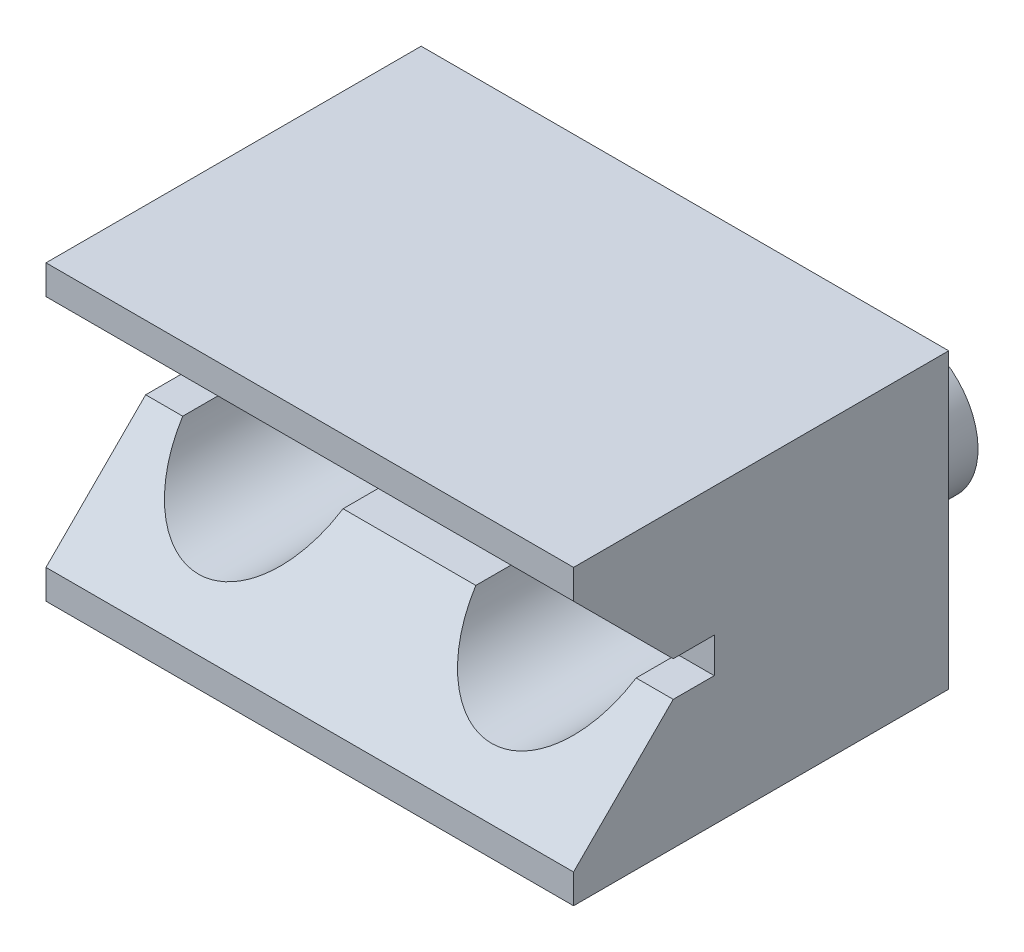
ISO-10303-21;
HEADER;
FILE_DESCRIPTION(('STEP AP214'),'2;1');
FILE_NAME('part.step','',(''),(''),'','','');
FILE_SCHEMA(('AUTOMOTIVE_DESIGN { 1 0 10303 214 1 1 1 1 }'));
ENDSEC;
DATA;
#1=APPLICATION_CONTEXT('core data for automotive mechanical design processes');
#2=APPLICATION_PROTOCOL_DEFINITION('international standard','automotive_design',2000,#1);
#3=PRODUCT_CONTEXT('',#1,'mechanical');
#4=PRODUCT('Part','Part','',(#3));
#5=PRODUCT_RELATED_PRODUCT_CATEGORY('part','',(#4));
#6=PRODUCT_DEFINITION_FORMATION('','',#4);
#7=PRODUCT_DEFINITION_CONTEXT('part definition',#1,'design');
#8=PRODUCT_DEFINITION('design','',#6,#7);
#9=PRODUCT_DEFINITION_SHAPE('','',#8);
#10=(LENGTH_UNIT() NAMED_UNIT(*) SI_UNIT(.MILLI.,.METRE.));
#11=(NAMED_UNIT(*) PLANE_ANGLE_UNIT() SI_UNIT($,.RADIAN.));
#12=(NAMED_UNIT(*) SI_UNIT($,.STERADIAN.) SOLID_ANGLE_UNIT());
#13=UNCERTAINTY_MEASURE_WITH_UNIT(LENGTH_MEASURE(1.E-05),#10,'distance_accuracy_value','');
#14=(GEOMETRIC_REPRESENTATION_CONTEXT(3) GLOBAL_UNCERTAINTY_ASSIGNED_CONTEXT((#13)) GLOBAL_UNIT_ASSIGNED_CONTEXT((#10,
#11,#12)) REPRESENTATION_CONTEXT('',''));
#15=CARTESIAN_POINT('',(0.,0.,0.));
#16=DIRECTION('',(0.,0.,1.));
#17=DIRECTION('',(1.,0.,0.));
#18=AXIS2_PLACEMENT_3D('',#15,#16,#17);
#19=CARTESIAN_POINT('',(35.,-12.5,0.));
#20=DIRECTION('',(0.,0.,1.));
#21=DIRECTION('',(0.,-1.,0.));
#22=AXIS2_PLACEMENT_3D('',#19,#20,#21);
#23=PLANE('',#22);
#24=CARTESIAN_POINT('',(0.,0.,0.));
#25=DIRECTION('',(0.,0.,1.));
#26=DIRECTION('',(0.,-1.,0.));
#27=AXIS2_PLACEMENT_3D('',#24,#25,#26);
#28=CIRCLE('',#27,6.);
#29=CARTESIAN_POINT('',(0.,-6.,0.));
#30=VERTEX_POINT('',#29);
#31=EDGE_CURVE('E405',#30,#30,#28,.T.);
#32=ORIENTED_EDGE('',*,*,#31,.T.);
#33=EDGE_LOOP('',(#32));
#34=FACE_BOUND('',#33,.T.);
#35=CARTESIAN_POINT('',(25.,0.,0.));
#36=DIRECTION('',(0.,0.,1.));
#37=DIRECTION('',(0.,-1.,0.));
#38=AXIS2_PLACEMENT_3D('',#35,#36,#37);
#39=CIRCLE('',#38,6.);
#40=CARTESIAN_POINT('',(25.,-6.,0.));
#41=VERTEX_POINT('',#40);
#42=EDGE_CURVE('E421',#41,#41,#39,.T.);
#43=ORIENTED_EDGE('',*,*,#42,.T.);
#44=EDGE_LOOP('',(#43));
#45=FACE_BOUND('',#44,.T.);
#46=DIRECTION('',(-1.,0.,0.));
#47=VECTOR('',#46,1.);
#48=CARTESIAN_POINT('',(35.,12.5,0.));
#49=LINE('',#48,#47);
#50=CARTESIAN_POINT('',(35.,12.5,0.));
#51=VERTEX_POINT('',#50);
#52=CARTESIAN_POINT('',(-10.,12.5,0.));
#53=VERTEX_POINT('',#52);
#54=EDGE_CURVE('E178',#51,#53,#49,.T.);
#55=ORIENTED_EDGE('',*,*,#54,.F.);
#56=DIRECTION('',(0.,1.,0.));
#57=VECTOR('',#56,1.);
#58=CARTESIAN_POINT('',(35.,-12.5,0.));
#59=LINE('',#58,#57);
#60=CARTESIAN_POINT('',(35.,-12.5,0.));
#61=VERTEX_POINT('',#60);
#62=EDGE_CURVE('E235',#61,#51,#59,.T.);
#63=ORIENTED_EDGE('',*,*,#62,.F.);
#64=DIRECTION('',(-1.,0.,0.));
#65=VECTOR('',#64,1.);
#66=CARTESIAN_POINT('',(35.,-12.5,0.));
#67=LINE('',#66,#65);
#68=CARTESIAN_POINT('',(-10.,-12.5,0.));
#69=VERTEX_POINT('',#68);
#70=EDGE_CURVE('E180',#61,#69,#67,.T.);
#71=ORIENTED_EDGE('',*,*,#70,.T.);
#72=DIRECTION('',(0.,1.,0.));
#73=VECTOR('',#72,1.);
#74=CARTESIAN_POINT('',(-10.,-12.5,0.));
#75=LINE('',#74,#73);
#76=EDGE_CURVE('E207',#69,#53,#75,.T.);
#77=ORIENTED_EDGE('',*,*,#76,.T.);
#78=EDGE_LOOP('',(#55,#63,#71,#77));
#79=FACE_BOUND('',#78,.T.);
#80=ADVANCED_FACE('F14',(#34,#45,#79),#23,.F.);
#81=CARTESIAN_POINT('',(35.,10.,32.));
#82=DIRECTION('',(0.,0.707106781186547,-0.707106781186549));
#83=DIRECTION('',(0.,0.707106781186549,0.707106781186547));
#84=AXIS2_PLACEMENT_3D('',#81,#82,#83);
#85=PLANE('',#84);
#86=CARTESIAN_POINT('',(0.,0.,22.));
#87=DIRECTION('',(0.,0.707106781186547,-0.707106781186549));
#88=DIRECTION('',(0.,-0.707106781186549,-0.707106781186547));
#89=AXIS2_PLACEMENT_3D('',#86,#87,#88);
#90=ELLIPSE('',#89,9.89949493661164,7.);
#91=CARTESIAN_POINT('',(6.83739716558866,1.5,23.5));
#92=VERTEX_POINT('',#91);
#93=CARTESIAN_POINT('',(-6.83739716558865,1.5,23.5));
#94=VERTEX_POINT('',#93);
#95=EDGE_CURVE('E445',#92,#94,#90,.F.);
#96=ORIENTED_EDGE('',*,*,#95,.F.);
#97=DIRECTION('',(-1.,0.,0.));
#98=VECTOR('',#97,1.);
#99=CARTESIAN_POINT('',(35.,1.5,23.5));
#100=LINE('',#99,#98);
#101=CARTESIAN_POINT('',(18.1626028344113,1.5,23.5));
#102=VERTEX_POINT('',#101);
#103=EDGE_CURVE('E174',#102,#92,#100,.T.);
#104=ORIENTED_EDGE('',*,*,#103,.F.);
#105=CARTESIAN_POINT('',(25.,0.,22.));
#106=DIRECTION('',(0.,0.707106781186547,-0.707106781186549));
#107=DIRECTION('',(0.,-0.707106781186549,-0.707106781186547));
#108=AXIS2_PLACEMENT_3D('',#105,#106,#107);
#109=ELLIPSE('',#108,9.89949493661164,7.);
#110=CARTESIAN_POINT('',(31.8373971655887,1.5,23.5));
#111=VERTEX_POINT('',#110);
#112=EDGE_CURVE('E201',#111,#102,#109,.F.);
#113=ORIENTED_EDGE('',*,*,#112,.F.);
#114=CARTESIAN_POINT('',(35.,1.5,23.5));
#115=VERTEX_POINT('',#114);
#116=EDGE_CURVE('E170',#115,#111,#100,.T.);
#117=ORIENTED_EDGE('',*,*,#116,.F.);
#118=DIRECTION('',(0.,-0.707106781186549,-0.707106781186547));
#119=VECTOR('',#118,1.);
#120=CARTESIAN_POINT('',(35.,10.,32.));
#121=LINE('',#120,#119);
#122=CARTESIAN_POINT('',(35.,10.,32.));
#123=VERTEX_POINT('',#122);
#124=EDGE_CURVE('E244',#123,#115,#121,.T.);
#125=ORIENTED_EDGE('',*,*,#124,.F.);
#126=DIRECTION('',(-1.,0.,0.));
#127=VECTOR('',#126,1.);
#128=CARTESIAN_POINT('',(35.,10.,32.));
#129=LINE('',#128,#127);
#130=CARTESIAN_POINT('',(-10.,10.,32.));
#131=VERTEX_POINT('',#130);
#132=EDGE_CURVE('E173',#123,#131,#129,.T.);
#133=ORIENTED_EDGE('',*,*,#132,.T.);
#134=DIRECTION('',(0.,-0.707106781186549,-0.707106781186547));
#135=VECTOR('',#134,1.);
#136=CARTESIAN_POINT('',(-10.,10.,32.));
#137=LINE('',#136,#135);
#138=CARTESIAN_POINT('',(-10.,1.5,23.5));
#139=VERTEX_POINT('',#138);
#140=EDGE_CURVE('E221',#131,#139,#137,.T.);
#141=ORIENTED_EDGE('',*,*,#140,.T.);
#142=EDGE_CURVE('E168',#94,#139,#100,.T.);
#143=ORIENTED_EDGE('',*,*,#142,.F.);
#144=EDGE_LOOP('',(#96,#104,#113,#117,#125,#133,#141,#143));
#145=FACE_BOUND('',#144,.T.);
#146=ADVANCED_FACE('F289',(#145),#85,.F.);
#147=CARTESIAN_POINT('',(35.,1.5,20.));
#148=DIRECTION('',(0.,-1.,0.));
#149=DIRECTION('',(0.,0.,-1.));
#150=AXIS2_PLACEMENT_3D('',#147,#148,#149);
#151=PLANE('',#150);
#152=DIRECTION('',(-1.,0.,0.));
#153=VECTOR('',#152,1.);
#154=CARTESIAN_POINT('',(35.,1.5,20.));
#155=LINE('',#154,#153);
#156=CARTESIAN_POINT('',(-6.83739716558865,1.5,20.));
#157=VERTEX_POINT('',#156);
#158=CARTESIAN_POINT('',(-10.,1.5,20.));
#159=VERTEX_POINT('',#158);
#160=EDGE_CURVE('E164',#157,#159,#155,.T.);
#161=ORIENTED_EDGE('',*,*,#160,.F.);
#162=DIRECTION('',(0.,0.,-1.));
#163=VECTOR('',#162,1.);
#164=CARTESIAN_POINT('',(-6.83739716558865,1.5,0.));
#165=LINE('',#164,#163);
#166=EDGE_CURVE('E442',#157,#94,#165,.F.);
#167=ORIENTED_EDGE('',*,*,#166,.T.);
#168=ORIENTED_EDGE('',*,*,#142,.T.);
#169=DIRECTION('',(0.,0.,1.));
#170=VECTOR('',#169,1.);
#171=CARTESIAN_POINT('',(-10.,1.5,20.));
#172=LINE('',#171,#170);
#173=EDGE_CURVE('E224',#159,#139,#172,.T.);
#174=ORIENTED_EDGE('',*,*,#173,.F.);
#175=EDGE_LOOP('',(#161,#167,#168,#174));
#176=FACE_BOUND('',#175,.T.);
#177=ADVANCED_FACE('F311',(#176),#151,.T.);
#178=ORIENTED_EDGE('',*,*,#103,.T.);
#179=DIRECTION('',(0.,0.,-1.));
#180=VECTOR('',#179,1.);
#181=CARTESIAN_POINT('',(6.83739716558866,1.5,0.));
#182=LINE('',#181,#180);
#183=CARTESIAN_POINT('',(6.83739716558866,1.5,20.));
#184=VERTEX_POINT('',#183);
#185=EDGE_CURVE('E439',#92,#184,#182,.T.);
#186=ORIENTED_EDGE('',*,*,#185,.T.);
#187=CARTESIAN_POINT('',(18.1626028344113,1.5,20.));
#188=VERTEX_POINT('',#187);
#189=EDGE_CURVE('E169',#188,#184,#155,.T.);
#190=ORIENTED_EDGE('',*,*,#189,.F.);
#191=DIRECTION('',(0.,0.,-1.));
#192=VECTOR('',#191,1.);
#193=CARTESIAN_POINT('',(18.1626028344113,1.5,0.));
#194=LINE('',#193,#192);
#195=EDGE_CURVE('E278',#188,#102,#194,.F.);
#196=ORIENTED_EDGE('',*,*,#195,.T.);
#197=EDGE_LOOP('',(#178,#186,#190,#196));
#198=FACE_BOUND('',#197,.T.);
#199=ADVANCED_FACE('F322',(#198),#151,.T.);
#200=CARTESIAN_POINT('',(35.,-1.5,20.));
#201=DIRECTION('',(0.,0.,1.));
#202=DIRECTION('',(0.,-1.,0.));
#203=AXIS2_PLACEMENT_3D('',#200,#201,#202);
#204=PLANE('',#203);
#205=DIRECTION('',(-1.,0.,0.));
#206=VECTOR('',#205,1.);
#207=CARTESIAN_POINT('',(35.,-1.5,20.));
#208=LINE('',#207,#206);
#209=CARTESIAN_POINT('',(-6.83739716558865,-1.5,20.));
#210=VERTEX_POINT('',#209);
#211=CARTESIAN_POINT('',(-10.,-1.5,20.));
#212=VERTEX_POINT('',#211);
#213=EDGE_CURVE('E156',#210,#212,#208,.T.);
#214=ORIENTED_EDGE('',*,*,#213,.F.);
#215=CARTESIAN_POINT('',(0.,0.,20.));
#216=DIRECTION('',(0.,0.,1.));
#217=DIRECTION('',(0.,-1.,0.));
#218=AXIS2_PLACEMENT_3D('',#215,#216,#217);
#219=CIRCLE('',#218,7.);
#220=EDGE_CURVE('E438',#210,#157,#219,.F.);
#221=ORIENTED_EDGE('',*,*,#220,.T.);
#222=ORIENTED_EDGE('',*,*,#160,.T.);
#223=DIRECTION('',(0.,1.,0.));
#224=VECTOR('',#223,1.);
#225=CARTESIAN_POINT('',(-10.,-1.5,20.));
#226=LINE('',#225,#224);
#227=EDGE_CURVE('E227',#212,#159,#226,.T.);
#228=ORIENTED_EDGE('',*,*,#227,.F.);
#229=EDGE_LOOP('',(#214,#221,#222,#228));
#230=FACE_BOUND('',#229,.T.);
#231=ADVANCED_FACE('F324',(#230),#204,.T.);
#232=ORIENTED_EDGE('',*,*,#189,.T.);
#233=CARTESIAN_POINT('',(6.83739716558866,-1.5,20.));
#234=VERTEX_POINT('',#233);
#235=EDGE_CURVE('E149',#184,#234,#219,.F.);
#236=ORIENTED_EDGE('',*,*,#235,.T.);
#237=CARTESIAN_POINT('',(18.1626028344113,-1.5,20.));
#238=VERTEX_POINT('',#237);
#239=EDGE_CURVE('E148',#238,#234,#208,.T.);
#240=ORIENTED_EDGE('',*,*,#239,.F.);
#241=CARTESIAN_POINT('',(25.,0.,20.));
#242=DIRECTION('',(0.,0.,1.));
#243=DIRECTION('',(0.,-1.,0.));
#244=AXIS2_PLACEMENT_3D('',#241,#242,#243);
#245=CIRCLE('',#244,7.);
#246=EDGE_CURVE('E270',#238,#188,#245,.F.);
#247=ORIENTED_EDGE('',*,*,#246,.T.);
#248=EDGE_LOOP('',(#232,#236,#240,#247));
#249=FACE_BOUND('',#248,.T.);
#250=ADVANCED_FACE('F327',(#249),#204,.T.);
#251=CARTESIAN_POINT('',(35.,-1.5,23.5));
#252=DIRECTION('',(0.,1.,0.));
#253=DIRECTION('',(0.,0.,1.));
#254=AXIS2_PLACEMENT_3D('',#251,#252,#253);
#255=PLANE('',#254);
#256=ORIENTED_EDGE('',*,*,#239,.T.);
#257=DIRECTION('',(0.,0.,-1.));
#258=VECTOR('',#257,1.);
#259=CARTESIAN_POINT('',(6.83739716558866,-1.5,0.));
#260=LINE('',#259,#258);
#261=CARTESIAN_POINT('',(6.83739716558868,-1.5,23.5));
#262=VERTEX_POINT('',#261);
#263=EDGE_CURVE('E137',#234,#262,#260,.F.);
#264=ORIENTED_EDGE('',*,*,#263,.T.);
#265=DIRECTION('',(-1.,0.,0.));
#266=VECTOR('',#265,1.);
#267=CARTESIAN_POINT('',(35.,-1.5,23.5));
#268=LINE('',#267,#266);
#269=CARTESIAN_POINT('',(18.1626028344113,-1.5,23.5));
#270=VERTEX_POINT('',#269);
#271=EDGE_CURVE('E146',#270,#262,#268,.T.);
#272=ORIENTED_EDGE('',*,*,#271,.F.);
#273=DIRECTION('',(0.,0.,-1.));
#274=VECTOR('',#273,1.);
#275=CARTESIAN_POINT('',(18.1626028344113,-1.5,0.));
#276=LINE('',#275,#274);
#277=EDGE_CURVE('E36',#270,#238,#276,.T.);
#278=ORIENTED_EDGE('',*,*,#277,.T.);
#279=EDGE_LOOP('',(#256,#264,#272,#278));
#280=FACE_BOUND('',#279,.T.);
#281=ADVANCED_FACE('F145',(#280),#255,.T.);
#282=CARTESIAN_POINT('',(-6.83739716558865,-1.5,23.5));
#283=VERTEX_POINT('',#282);
#284=CARTESIAN_POINT('',(-10.,-1.5,23.5));
#285=VERTEX_POINT('',#284);
#286=EDGE_CURVE('E154',#283,#285,#268,.T.);
#287=ORIENTED_EDGE('',*,*,#286,.F.);
#288=DIRECTION('',(0.,0.,-1.));
#289=VECTOR('',#288,1.);
#290=CARTESIAN_POINT('',(-6.83739716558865,-1.5,0.));
#291=LINE('',#290,#289);
#292=EDGE_CURVE('E29',#283,#210,#291,.T.);
#293=ORIENTED_EDGE('',*,*,#292,.T.);
#294=ORIENTED_EDGE('',*,*,#213,.T.);
#295=DIRECTION('',(0.,0.,-1.));
#296=VECTOR('',#295,1.);
#297=CARTESIAN_POINT('',(-10.,-1.5,23.5));
#298=LINE('',#297,#296);
#299=EDGE_CURVE('E230',#285,#212,#298,.T.);
#300=ORIENTED_EDGE('',*,*,#299,.F.);
#301=EDGE_LOOP('',(#287,#293,#294,#300));
#302=FACE_BOUND('',#301,.T.);
#303=ADVANCED_FACE('F332',(#302),#255,.T.);
#304=CARTESIAN_POINT('',(35.,-10.,32.));
#305=DIRECTION('',(0.,0.707106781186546,0.707106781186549));
#306=DIRECTION('',(0.,-0.707106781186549,0.707106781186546));
#307=AXIS2_PLACEMENT_3D('',#304,#305,#306);
#308=PLANE('',#307);
#309=ORIENTED_EDGE('',*,*,#271,.T.);
#310=CARTESIAN_POINT('',(0.,0.,22.));
#311=DIRECTION('',(0.,0.707106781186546,0.707106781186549));
#312=DIRECTION('',(0.,0.707106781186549,-0.707106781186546));
#313=AXIS2_PLACEMENT_3D('',#310,#311,#312);
#314=ELLIPSE('',#313,9.89949493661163,7.);
#315=EDGE_CURVE('E9',#262,#283,#314,.F.);
#316=ORIENTED_EDGE('',*,*,#315,.T.);
#317=ORIENTED_EDGE('',*,*,#286,.T.);
#318=DIRECTION('',(0.,0.707106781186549,-0.707106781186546));
#319=VECTOR('',#318,1.);
#320=CARTESIAN_POINT('',(-10.,-10.,32.));
#321=LINE('',#320,#319);
#322=CARTESIAN_POINT('',(-10.,-10.,32.));
#323=VERTEX_POINT('',#322);
#324=EDGE_CURVE('E200',#323,#285,#321,.T.);
#325=ORIENTED_EDGE('',*,*,#324,.F.);
#326=DIRECTION('',(-1.,0.,0.));
#327=VECTOR('',#326,1.);
#328=CARTESIAN_POINT('',(35.,-10.,32.));
#329=LINE('',#328,#327);
#330=CARTESIAN_POINT('',(35.,-10.,32.));
#331=VERTEX_POINT('',#330);
#332=EDGE_CURVE('E157',#331,#323,#329,.T.);
#333=ORIENTED_EDGE('',*,*,#332,.F.);
#334=DIRECTION('',(0.,0.707106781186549,-0.707106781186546));
#335=VECTOR('',#334,1.);
#336=CARTESIAN_POINT('',(35.,-10.,32.));
#337=LINE('',#336,#335);
#338=CARTESIAN_POINT('',(35.,-1.5,23.5));
#339=VERTEX_POINT('',#338);
#340=EDGE_CURVE('E210',#331,#339,#337,.T.);
#341=ORIENTED_EDGE('',*,*,#340,.T.);
#342=CARTESIAN_POINT('',(31.8373971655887,-1.5,23.5));
#343=VERTEX_POINT('',#342);
#344=EDGE_CURVE('E153',#339,#343,#268,.T.);
#345=ORIENTED_EDGE('',*,*,#344,.T.);
#346=CARTESIAN_POINT('',(25.,0.,22.));
#347=DIRECTION('',(0.,0.707106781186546,0.707106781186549));
#348=DIRECTION('',(0.,0.707106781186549,-0.707106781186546));
#349=AXIS2_PLACEMENT_3D('',#346,#347,#348);
#350=ELLIPSE('',#349,9.89949493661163,7.);
#351=EDGE_CURVE('E22',#343,#270,#350,.F.);
#352=ORIENTED_EDGE('',*,*,#351,.T.);
#353=EDGE_LOOP('',(#309,#316,#317,#325,#333,#341,#345,#352));
#354=FACE_BOUND('',#353,.T.);
#355=ADVANCED_FACE('F151',(#354),#308,.T.);
#356=ORIENTED_EDGE('',*,*,#116,.T.);
#357=DIRECTION('',(0.,0.,-1.));
#358=VECTOR('',#357,1.);
#359=CARTESIAN_POINT('',(31.8373971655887,1.5,0.));
#360=LINE('',#359,#358);
#361=CARTESIAN_POINT('',(31.8373971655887,1.5,20.));
#362=VERTEX_POINT('',#361);
#363=EDGE_CURVE('E276',#111,#362,#360,.T.);
#364=ORIENTED_EDGE('',*,*,#363,.T.);
#365=CARTESIAN_POINT('',(35.,1.5,20.));
#366=VERTEX_POINT('',#365);
#367=EDGE_CURVE('E165',#366,#362,#155,.T.);
#368=ORIENTED_EDGE('',*,*,#367,.F.);
#369=DIRECTION('',(0.,0.,1.));
#370=VECTOR('',#369,1.);
#371=CARTESIAN_POINT('',(35.,1.5,20.));
#372=LINE('',#371,#370);
#373=EDGE_CURVE('E247',#366,#115,#372,.T.);
#374=ORIENTED_EDGE('',*,*,#373,.T.);
#375=EDGE_LOOP('',(#356,#364,#368,#374));
#376=FACE_BOUND('',#375,.T.);
#377=ADVANCED_FACE('F292',(#376),#151,.T.);
#378=ORIENTED_EDGE('',*,*,#367,.T.);
#379=CARTESIAN_POINT('',(31.8373971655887,-1.5,20.));
#380=VERTEX_POINT('',#379);
#381=EDGE_CURVE('E268',#362,#380,#245,.F.);
#382=ORIENTED_EDGE('',*,*,#381,.T.);
#383=CARTESIAN_POINT('',(35.,-1.5,20.));
#384=VERTEX_POINT('',#383);
#385=EDGE_CURVE('E161',#384,#380,#208,.T.);
#386=ORIENTED_EDGE('',*,*,#385,.F.);
#387=DIRECTION('',(0.,1.,0.));
#388=VECTOR('',#387,1.);
#389=CARTESIAN_POINT('',(35.,-1.5,20.));
#390=LINE('',#389,#388);
#391=EDGE_CURVE('E250',#384,#366,#390,.T.);
#392=ORIENTED_EDGE('',*,*,#391,.T.);
#393=EDGE_LOOP('',(#378,#382,#386,#392));
#394=FACE_BOUND('',#393,.T.);
#395=ADVANCED_FACE('F329',(#394),#204,.T.);
#396=ORIENTED_EDGE('',*,*,#385,.T.);
#397=DIRECTION('',(0.,0.,-1.));
#398=VECTOR('',#397,1.);
#399=CARTESIAN_POINT('',(31.8373971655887,-1.5,0.));
#400=LINE('',#399,#398);
#401=EDGE_CURVE('E266',#380,#343,#400,.F.);
#402=ORIENTED_EDGE('',*,*,#401,.T.);
#403=ORIENTED_EDGE('',*,*,#344,.F.);
#404=DIRECTION('',(0.,0.,-1.));
#405=VECTOR('',#404,1.);
#406=CARTESIAN_POINT('',(35.,-1.5,23.5));
#407=LINE('',#406,#405);
#408=EDGE_CURVE('E253',#339,#384,#407,.T.);
#409=ORIENTED_EDGE('',*,*,#408,.T.);
#410=EDGE_LOOP('',(#396,#402,#403,#409));
#411=FACE_BOUND('',#410,.T.);
#412=ADVANCED_FACE('F264',(#411),#255,.T.);
#413=CARTESIAN_POINT('',(35.,-12.5,32.));
#414=DIRECTION('',(0.,0.,1.));
#415=DIRECTION('',(0.,-1.,0.));
#416=AXIS2_PLACEMENT_3D('',#413,#414,#415);
#417=PLANE('',#416);
#418=DIRECTION('',(-1.,0.,0.));
#419=VECTOR('',#418,1.);
#420=CARTESIAN_POINT('',(35.,-12.5,32.));
#421=LINE('',#420,#419);
#422=CARTESIAN_POINT('',(35.,-12.5,32.));
#423=VERTEX_POINT('',#422);
#424=CARTESIAN_POINT('',(-10.,-12.5,32.));
#425=VERTEX_POINT('',#424);
#426=EDGE_CURVE('E182',#423,#425,#421,.T.);
#427=ORIENTED_EDGE('',*,*,#426,.F.);
#428=DIRECTION('',(0.,1.,0.));
#429=VECTOR('',#428,1.);
#430=CARTESIAN_POINT('',(35.,-12.5,32.));
#431=LINE('',#430,#429);
#432=EDGE_CURVE('E208',#423,#331,#431,.T.);
#433=ORIENTED_EDGE('',*,*,#432,.T.);
#434=ORIENTED_EDGE('',*,*,#332,.T.);
#435=DIRECTION('',(0.,1.,0.));
#436=VECTOR('',#435,1.);
#437=CARTESIAN_POINT('',(-10.,-12.5,32.));
#438=LINE('',#437,#436);
#439=EDGE_CURVE('E195',#425,#323,#438,.T.);
#440=ORIENTED_EDGE('',*,*,#439,.F.);
#441=EDGE_LOOP('',(#427,#433,#434,#440));
#442=FACE_BOUND('',#441,.T.);
#443=ADVANCED_FACE('F196',(#442),#417,.T.);
#444=CARTESIAN_POINT('',(35.,-12.5,32.));
#445=DIRECTION('',(0.,1.,0.));
#446=DIRECTION('',(0.,0.,1.));
#447=AXIS2_PLACEMENT_3D('',#444,#445,#446);
#448=PLANE('',#447);
#449=ORIENTED_EDGE('',*,*,#70,.F.);
#450=DIRECTION('',(0.,0.,-1.));
#451=VECTOR('',#450,1.);
#452=CARTESIAN_POINT('',(35.,-12.5,32.));
#453=LINE('',#452,#451);
#454=EDGE_CURVE('E190',#423,#61,#453,.T.);
#455=ORIENTED_EDGE('',*,*,#454,.F.);
#456=ORIENTED_EDGE('',*,*,#426,.T.);
#457=DIRECTION('',(0.,0.,-1.));
#458=VECTOR('',#457,1.);
#459=CARTESIAN_POINT('',(-10.,-12.5,32.));
#460=LINE('',#459,#458);
#461=EDGE_CURVE('E188',#425,#69,#460,.T.);
#462=ORIENTED_EDGE('',*,*,#461,.T.);
#463=EDGE_LOOP('',(#449,#455,#456,#462));
#464=FACE_BOUND('',#463,.T.);
#465=ADVANCED_FACE('F16',(#464),#448,.F.);
#466=CARTESIAN_POINT('',(35.,12.5,0.));
#467=DIRECTION('',(0.,-1.,0.));
#468=DIRECTION('',(0.,0.,-1.));
#469=AXIS2_PLACEMENT_3D('',#466,#467,#468);
#470=PLANE('',#469);
#471=DIRECTION('',(-1.,0.,0.));
#472=VECTOR('',#471,1.);
#473=CARTESIAN_POINT('',(35.,12.5,32.));
#474=LINE('',#473,#472);
#475=CARTESIAN_POINT('',(35.,12.5,32.));
#476=VERTEX_POINT('',#475);
#477=CARTESIAN_POINT('',(-10.,12.5,32.));
#478=VERTEX_POINT('',#477);
#479=EDGE_CURVE('E176',#476,#478,#474,.T.);
#480=ORIENTED_EDGE('',*,*,#479,.F.);
#481=DIRECTION('',(0.,0.,1.));
#482=VECTOR('',#481,1.);
#483=CARTESIAN_POINT('',(35.,12.5,0.));
#484=LINE('',#483,#482);
#485=EDGE_CURVE('E238',#51,#476,#484,.T.);
#486=ORIENTED_EDGE('',*,*,#485,.F.);
#487=ORIENTED_EDGE('',*,*,#54,.T.);
#488=DIRECTION('',(0.,0.,1.));
#489=VECTOR('',#488,1.);
#490=CARTESIAN_POINT('',(-10.,12.5,0.));
#491=LINE('',#490,#489);
#492=EDGE_CURVE('E211',#53,#478,#491,.T.);
#493=ORIENTED_EDGE('',*,*,#492,.T.);
#494=EDGE_LOOP('',(#480,#486,#487,#493));
#495=FACE_BOUND('',#494,.T.);
#496=ADVANCED_FACE('F302',(#495),#470,.F.);
#497=CARTESIAN_POINT('',(35.,12.5,32.));
#498=DIRECTION('',(0.,0.,-1.));
#499=DIRECTION('',(0.,1.,0.));
#500=AXIS2_PLACEMENT_3D('',#497,#498,#499);
#501=PLANE('',#500);
#502=ORIENTED_EDGE('',*,*,#132,.F.);
#503=DIRECTION('',(0.,-1.,0.));
#504=VECTOR('',#503,1.);
#505=CARTESIAN_POINT('',(35.,12.5,32.));
#506=LINE('',#505,#504);
#507=EDGE_CURVE('E241',#476,#123,#506,.T.);
#508=ORIENTED_EDGE('',*,*,#507,.F.);
#509=ORIENTED_EDGE('',*,*,#479,.T.);
#510=DIRECTION('',(0.,-1.,0.));
#511=VECTOR('',#510,1.);
#512=CARTESIAN_POINT('',(-10.,12.5,32.));
#513=LINE('',#512,#511);
#514=EDGE_CURVE('E218',#478,#131,#513,.T.);
#515=ORIENTED_EDGE('',*,*,#514,.T.);
#516=EDGE_LOOP('',(#502,#508,#509,#515));
#517=FACE_BOUND('',#516,.T.);
#518=ADVANCED_FACE('F299',(#517),#501,.F.);
#519=CARTESIAN_POINT('',(35.,1.5,32.));
#520=DIRECTION('',(1.,0.,0.));
#521=DIRECTION('',(0.,0.,1.));
#522=AXIS2_PLACEMENT_3D('',#519,#520,#521);
#523=PLANE('',#522);
#524=ORIENTED_EDGE('',*,*,#432,.F.);
#525=ORIENTED_EDGE('',*,*,#454,.T.);
#526=ORIENTED_EDGE('',*,*,#62,.T.);
#527=ORIENTED_EDGE('',*,*,#485,.T.);
#528=ORIENTED_EDGE('',*,*,#507,.T.);
#529=ORIENTED_EDGE('',*,*,#124,.T.);
#530=ORIENTED_EDGE('',*,*,#373,.F.);
#531=ORIENTED_EDGE('',*,*,#391,.F.);
#532=ORIENTED_EDGE('',*,*,#408,.F.);
#533=ORIENTED_EDGE('',*,*,#340,.F.);
#534=EDGE_LOOP('',(#524,#525,#526,#527,#528,#529,#530,#531,#532,#533));
#535=FACE_BOUND('',#534,.T.);
#536=ADVANCED_FACE('F261',(#535),#523,.T.);
#537=CARTESIAN_POINT('',(-10.,1.5,32.));
#538=DIRECTION('',(1.,0.,0.));
#539=DIRECTION('',(0.,0.,1.));
#540=AXIS2_PLACEMENT_3D('',#537,#538,#539);
#541=PLANE('',#540);
#542=ORIENTED_EDGE('',*,*,#439,.T.);
#543=ORIENTED_EDGE('',*,*,#324,.T.);
#544=ORIENTED_EDGE('',*,*,#299,.T.);
#545=ORIENTED_EDGE('',*,*,#227,.T.);
#546=ORIENTED_EDGE('',*,*,#173,.T.);
#547=ORIENTED_EDGE('',*,*,#140,.F.);
#548=ORIENTED_EDGE('',*,*,#514,.F.);
#549=ORIENTED_EDGE('',*,*,#492,.F.);
#550=ORIENTED_EDGE('',*,*,#76,.F.);
#551=ORIENTED_EDGE('',*,*,#461,.F.);
#552=EDGE_LOOP('',(#542,#543,#544,#545,#546,#547,#548,#549,#550,#551));
#553=FACE_BOUND('',#552,.T.);
#554=ADVANCED_FACE('F204',(#553),#541,.F.);
#555=CARTESIAN_POINT('',(25.,0.,0.));
#556=DIRECTION('',(0.,0.,-1.));
#557=DIRECTION('',(0.,1.,0.));
#558=AXIS2_PLACEMENT_3D('',#555,#556,#557);
#559=CYLINDRICAL_SURFACE('',#558,7.);
#560=CARTESIAN_POINT('',(25.,0.,13.));
#561=DIRECTION('',(0.,0.,-1.));
#562=DIRECTION('',(0.,1.,0.));
#563=AXIS2_PLACEMENT_3D('',#560,#561,#562);
#564=CIRCLE('',#563,7.);
#565=CARTESIAN_POINT('',(25.,7.,13.));
#566=VERTEX_POINT('',#565);
#567=EDGE_CURVE('E272',#566,#566,#564,.T.);
#568=ORIENTED_EDGE('',*,*,#567,.T.);
#569=EDGE_LOOP('',(#568));
#570=FACE_BOUND('',#569,.T.);
#571=ORIENTED_EDGE('',*,*,#112,.T.);
#572=ORIENTED_EDGE('',*,*,#195,.F.);
#573=ORIENTED_EDGE('',*,*,#246,.F.);
#574=ORIENTED_EDGE('',*,*,#277,.F.);
#575=ORIENTED_EDGE('',*,*,#351,.F.);
#576=ORIENTED_EDGE('',*,*,#401,.F.);
#577=ORIENTED_EDGE('',*,*,#381,.F.);
#578=ORIENTED_EDGE('',*,*,#363,.F.);
#579=EDGE_LOOP('',(#571,#572,#573,#574,#575,#576,#577,#578));
#580=FACE_BOUND('',#579,.T.);
#581=ADVANCED_FACE('F285',(#570,#580),#559,.F.);
#582=CARTESIAN_POINT('',(25.,-7.,13.));
#583=DIRECTION('',(0.,0.,1.));
#584=DIRECTION('',(0.,-1.,0.));
#585=AXIS2_PLACEMENT_3D('',#582,#583,#584);
#586=PLANE('',#585);
#587=CARTESIAN_POINT('',(25.,0.,13.));
#588=DIRECTION('',(0.,0.,-1.));
#589=DIRECTION('',(0.,1.,0.));
#590=AXIS2_PLACEMENT_3D('',#587,#588,#589);
#591=CIRCLE('',#590,4.5);
#592=CARTESIAN_POINT('',(25.,4.5,13.));
#593=VERTEX_POINT('',#592);
#594=EDGE_CURVE('E447',#593,#593,#591,.T.);
#595=ORIENTED_EDGE('',*,*,#594,.T.);
#596=EDGE_LOOP('',(#595));
#597=FACE_BOUND('',#596,.T.);
#598=ORIENTED_EDGE('',*,*,#567,.F.);
#599=EDGE_LOOP('',(#598));
#600=FACE_BOUND('',#599,.T.);
#601=ADVANCED_FACE('F343',(#597,#600),#586,.T.);
#602=CARTESIAN_POINT('',(25.,0.,0.));
#603=DIRECTION('',(0.,0.,-1.));
#604=DIRECTION('',(0.,1.,0.));
#605=AXIS2_PLACEMENT_3D('',#602,#603,#604);
#606=CYLINDRICAL_SURFACE('',#605,4.5);
#607=CARTESIAN_POINT('',(25.,0.,0.));
#608=DIRECTION('',(0.,0.,1.));
#609=DIRECTION('',(0.,-1.,0.));
#610=AXIS2_PLACEMENT_3D('',#607,#608,#609);
#611=CIRCLE('',#610,4.5);
#612=CARTESIAN_POINT('',(25.,-4.5,0.));
#613=VERTEX_POINT('',#612);
#614=EDGE_CURVE('E427',#613,#613,#611,.T.);
#615=ORIENTED_EDGE('',*,*,#614,.F.);
#616=EDGE_LOOP('',(#615));
#617=FACE_BOUND('',#616,.T.);
#618=ORIENTED_EDGE('',*,*,#594,.F.);
#619=EDGE_LOOP('',(#618));
#620=FACE_BOUND('',#619,.T.);
#621=ADVANCED_FACE('F347',(#617,#620),#606,.F.);
#622=CARTESIAN_POINT('',(0.,0.,0.));
#623=DIRECTION('',(0.,0.,-1.));
#624=DIRECTION('',(0.,1.,0.));
#625=AXIS2_PLACEMENT_3D('',#622,#623,#624);
#626=CYLINDRICAL_SURFACE('',#625,7.);
#627=CARTESIAN_POINT('',(0.,0.,13.));
#628=DIRECTION('',(0.,0.,-1.));
#629=DIRECTION('',(0.,1.,0.));
#630=AXIS2_PLACEMENT_3D('',#627,#628,#629);
#631=CIRCLE('',#630,7.);
#632=CARTESIAN_POINT('',(0.,7.,13.));
#633=VERTEX_POINT('',#632);
#634=EDGE_CURVE('E433',#633,#633,#631,.T.);
#635=ORIENTED_EDGE('',*,*,#634,.T.);
#636=EDGE_LOOP('',(#635));
#637=FACE_BOUND('',#636,.T.);
#638=ORIENTED_EDGE('',*,*,#95,.T.);
#639=ORIENTED_EDGE('',*,*,#166,.F.);
#640=ORIENTED_EDGE('',*,*,#220,.F.);
#641=ORIENTED_EDGE('',*,*,#292,.F.);
#642=ORIENTED_EDGE('',*,*,#315,.F.);
#643=ORIENTED_EDGE('',*,*,#263,.F.);
#644=ORIENTED_EDGE('',*,*,#235,.F.);
#645=ORIENTED_EDGE('',*,*,#185,.F.);
#646=EDGE_LOOP('',(#638,#639,#640,#641,#642,#643,#644,#645));
#647=FACE_BOUND('',#646,.T.);
#648=ADVANCED_FACE('F136',(#637,#647),#626,.F.);
#649=CARTESIAN_POINT('',(0.,-7.,13.));
#650=DIRECTION('',(0.,0.,1.));
#651=DIRECTION('',(0.,-1.,0.));
#652=AXIS2_PLACEMENT_3D('',#649,#650,#651);
#653=PLANE('',#652);
#654=CARTESIAN_POINT('',(0.,0.,13.));
#655=DIRECTION('',(0.,0.,-1.));
#656=DIRECTION('',(0.,1.,0.));
#657=AXIS2_PLACEMENT_3D('',#654,#655,#656);
#658=CIRCLE('',#657,4.5);
#659=CARTESIAN_POINT('',(0.,4.5,13.));
#660=VERTEX_POINT('',#659);
#661=EDGE_CURVE('E430',#660,#660,#658,.T.);
#662=ORIENTED_EDGE('',*,*,#661,.T.);
#663=EDGE_LOOP('',(#662));
#664=FACE_BOUND('',#663,.T.);
#665=ORIENTED_EDGE('',*,*,#634,.F.);
#666=EDGE_LOOP('',(#665));
#667=FACE_BOUND('',#666,.T.);
#668=ADVANCED_FACE('F354',(#664,#667),#653,.T.);
#669=CARTESIAN_POINT('',(0.,0.,0.));
#670=DIRECTION('',(0.,0.,-1.));
#671=DIRECTION('',(0.,1.,0.));
#672=AXIS2_PLACEMENT_3D('',#669,#670,#671);
#673=CYLINDRICAL_SURFACE('',#672,4.5);
#674=CARTESIAN_POINT('',(0.,0.,0.));
#675=DIRECTION('',(0.,0.,1.));
#676=DIRECTION('',(0.,-1.,0.));
#677=AXIS2_PLACEMENT_3D('',#674,#675,#676);
#678=CIRCLE('',#677,4.5);
#679=CARTESIAN_POINT('',(0.,-4.5,0.));
#680=VERTEX_POINT('',#679);
#681=EDGE_CURVE('E412',#680,#680,#678,.T.);
#682=ORIENTED_EDGE('',*,*,#681,.F.);
#683=EDGE_LOOP('',(#682));
#684=FACE_BOUND('',#683,.T.);
#685=ORIENTED_EDGE('',*,*,#661,.F.);
#686=EDGE_LOOP('',(#685));
#687=FACE_BOUND('',#686,.T.);
#688=ADVANCED_FACE('F358',(#684,#687),#673,.F.);
#689=CARTESIAN_POINT('',(25.,0.,-6.5));
#690=DIRECTION('',(0.,0.,1.));
#691=DIRECTION('',(0.,-1.,0.));
#692=AXIS2_PLACEMENT_3D('',#689,#690,#691);
#693=CYLINDRICAL_SURFACE('',#692,6.);
#694=CARTESIAN_POINT('',(25.,0.,-6.5));
#695=DIRECTION('',(0.,0.,1.));
#696=DIRECTION('',(0.,-1.,0.));
#697=AXIS2_PLACEMENT_3D('',#694,#695,#696);
#698=CIRCLE('',#697,6.);
#699=CARTESIAN_POINT('',(25.,-6.,-6.5));
#700=VERTEX_POINT('',#699);
#701=EDGE_CURVE('E424',#700,#700,#698,.T.);
#702=ORIENTED_EDGE('',*,*,#701,.T.);
#703=EDGE_LOOP('',(#702));
#704=FACE_BOUND('',#703,.T.);
#705=ORIENTED_EDGE('',*,*,#42,.F.);
#706=EDGE_LOOP('',(#705));
#707=FACE_BOUND('',#706,.T.);
#708=ADVANCED_FACE('F362',(#704,#707),#693,.T.);
#709=CARTESIAN_POINT('',(25.,0.,-6.5));
#710=DIRECTION('',(0.,0.,1.));
#711=DIRECTION('',(0.,-1.,0.));
#712=AXIS2_PLACEMENT_3D('',#709,#710,#711);
#713=PLANE('',#712);
#714=CARTESIAN_POINT('',(25.,0.,-6.5));
#715=DIRECTION('',(0.,0.,1.));
#716=DIRECTION('',(0.,-1.,0.));
#717=AXIS2_PLACEMENT_3D('',#714,#715,#716);
#718=CIRCLE('',#717,4.25);
#719=CARTESIAN_POINT('',(25.,-4.25,-6.5));
#720=VERTEX_POINT('',#719);
#721=EDGE_CURVE('E418',#720,#720,#718,.T.);
#722=ORIENTED_EDGE('',*,*,#721,.T.);
#723=EDGE_LOOP('',(#722));
#724=FACE_BOUND('',#723,.T.);
#725=ORIENTED_EDGE('',*,*,#701,.F.);
#726=EDGE_LOOP('',(#725));
#727=FACE_BOUND('',#726,.T.);
#728=ADVANCED_FACE('F364',(#724,#727),#713,.F.);
#729=CARTESIAN_POINT('',(25.,0.,0.));
#730=DIRECTION('',(0.,0.,1.));
#731=DIRECTION('',(0.,-1.,0.));
#732=AXIS2_PLACEMENT_3D('',#729,#730,#731);
#733=PLANE('',#732);
#734=ORIENTED_EDGE('',*,*,#614,.T.);
#735=EDGE_LOOP('',(#734));
#736=FACE_BOUND('',#735,.T.);
#737=CARTESIAN_POINT('',(25.,0.,0.));
#738=DIRECTION('',(0.,0.,1.));
#739=DIRECTION('',(0.,-1.,0.));
#740=AXIS2_PLACEMENT_3D('',#737,#738,#739);
#741=CIRCLE('',#740,4.25);
#742=CARTESIAN_POINT('',(25.,-4.25,0.));
#743=VERTEX_POINT('',#742);
#744=EDGE_CURVE('E415',#743,#743,#741,.T.);
#745=ORIENTED_EDGE('',*,*,#744,.F.);
#746=EDGE_LOOP('',(#745));
#747=FACE_BOUND('',#746,.T.);
#748=ADVANCED_FACE('F368',(#736,#747),#733,.T.);
#749=CARTESIAN_POINT('',(25.,0.,-6.5));
#750=DIRECTION('',(0.,0.,1.));
#751=DIRECTION('',(0.,-1.,0.));
#752=AXIS2_PLACEMENT_3D('',#749,#750,#751);
#753=CYLINDRICAL_SURFACE('',#752,4.25);
#754=ORIENTED_EDGE('',*,*,#721,.F.);
#755=EDGE_LOOP('',(#754));
#756=FACE_BOUND('',#755,.T.);
#757=ORIENTED_EDGE('',*,*,#744,.T.);
#758=EDGE_LOOP('',(#757));
#759=FACE_BOUND('',#758,.T.);
#760=ADVANCED_FACE('F374',(#756,#759),#753,.F.);
#761=CARTESIAN_POINT('',(0.,0.,-6.5));
#762=DIRECTION('',(0.,0.,1.));
#763=DIRECTION('',(0.,-1.,0.));
#764=AXIS2_PLACEMENT_3D('',#761,#762,#763);
#765=CYLINDRICAL_SURFACE('',#764,6.);
#766=CARTESIAN_POINT('',(0.,0.,-6.5));
#767=DIRECTION('',(0.,0.,1.));
#768=DIRECTION('',(0.,-1.,0.));
#769=AXIS2_PLACEMENT_3D('',#766,#767,#768);
#770=CIRCLE('',#769,6.);
#771=CARTESIAN_POINT('',(0.,-6.,-6.5));
#772=VERTEX_POINT('',#771);
#773=EDGE_CURVE('E409',#772,#772,#770,.T.);
#774=ORIENTED_EDGE('',*,*,#773,.T.);
#775=EDGE_LOOP('',(#774));
#776=FACE_BOUND('',#775,.T.);
#777=ORIENTED_EDGE('',*,*,#31,.F.);
#778=EDGE_LOOP('',(#777));
#779=FACE_BOUND('',#778,.T.);
#780=ADVANCED_FACE('F378',(#776,#779),#765,.T.);
#781=CARTESIAN_POINT('',(0.,0.,-6.5));
#782=DIRECTION('',(0.,0.,1.));
#783=DIRECTION('',(0.,-1.,0.));
#784=AXIS2_PLACEMENT_3D('',#781,#782,#783);
#785=PLANE('',#784);
#786=CARTESIAN_POINT('',(0.,0.,-6.5));
#787=DIRECTION('',(0.,0.,1.));
#788=DIRECTION('',(0.,-1.,0.));
#789=AXIS2_PLACEMENT_3D('',#786,#787,#788);
#790=CIRCLE('',#789,4.25);
#791=CARTESIAN_POINT('',(0.,-4.25,-6.5));
#792=VERTEX_POINT('',#791);
#793=EDGE_CURVE('E399',#792,#792,#790,.T.);
#794=ORIENTED_EDGE('',*,*,#793,.T.);
#795=EDGE_LOOP('',(#794));
#796=FACE_BOUND('',#795,.T.);
#797=ORIENTED_EDGE('',*,*,#773,.F.);
#798=EDGE_LOOP('',(#797));
#799=FACE_BOUND('',#798,.T.);
#800=ADVANCED_FACE('F380',(#796,#799),#785,.F.);
#801=CARTESIAN_POINT('',(0.,0.,0.));
#802=DIRECTION('',(0.,0.,1.));
#803=DIRECTION('',(0.,-1.,0.));
#804=AXIS2_PLACEMENT_3D('',#801,#802,#803);
#805=PLANE('',#804);
#806=ORIENTED_EDGE('',*,*,#681,.T.);
#807=EDGE_LOOP('',(#806));
#808=FACE_BOUND('',#807,.T.);
#809=CARTESIAN_POINT('',(0.,0.,0.));
#810=DIRECTION('',(0.,0.,1.));
#811=DIRECTION('',(0.,-1.,0.));
#812=AXIS2_PLACEMENT_3D('',#809,#810,#811);
#813=CIRCLE('',#812,4.25);
#814=CARTESIAN_POINT('',(0.,-4.25,0.));
#815=VERTEX_POINT('',#814);
#816=EDGE_CURVE('E402',#815,#815,#813,.T.);
#817=ORIENTED_EDGE('',*,*,#816,.F.);
#818=EDGE_LOOP('',(#817));
#819=FACE_BOUND('',#818,.T.);
#820=ADVANCED_FACE('F384',(#808,#819),#805,.T.);
#821=CARTESIAN_POINT('',(0.,0.,-6.5));
#822=DIRECTION('',(0.,0.,1.));
#823=DIRECTION('',(0.,-1.,0.));
#824=AXIS2_PLACEMENT_3D('',#821,#822,#823);
#825=CYLINDRICAL_SURFACE('',#824,4.25);
#826=ORIENTED_EDGE('',*,*,#793,.F.);
#827=EDGE_LOOP('',(#826));
#828=FACE_BOUND('',#827,.T.);
#829=ORIENTED_EDGE('',*,*,#816,.T.);
#830=EDGE_LOOP('',(#829));
#831=FACE_BOUND('',#830,.T.);
#832=ADVANCED_FACE('F390',(#828,#831),#825,.F.);
#833=CLOSED_SHELL('',(#80,#146,#177,#199,#231,#250,#281,#303,#355,#377,#395,#412,#443,#465,#496,
#518,#536,#554,#581,#601,#621,#648,#668,#688,#708,#728,#748,#760,#780,#800,#820,#832));
#834=MANIFOLD_SOLID_BREP('B1',#833);
#835=ADVANCED_BREP_SHAPE_REPRESENTATION('',(#18,#834),#14);
#836=SHAPE_DEFINITION_REPRESENTATION(#9,#835);
ENDSEC;
END-ISO-10303-21;
